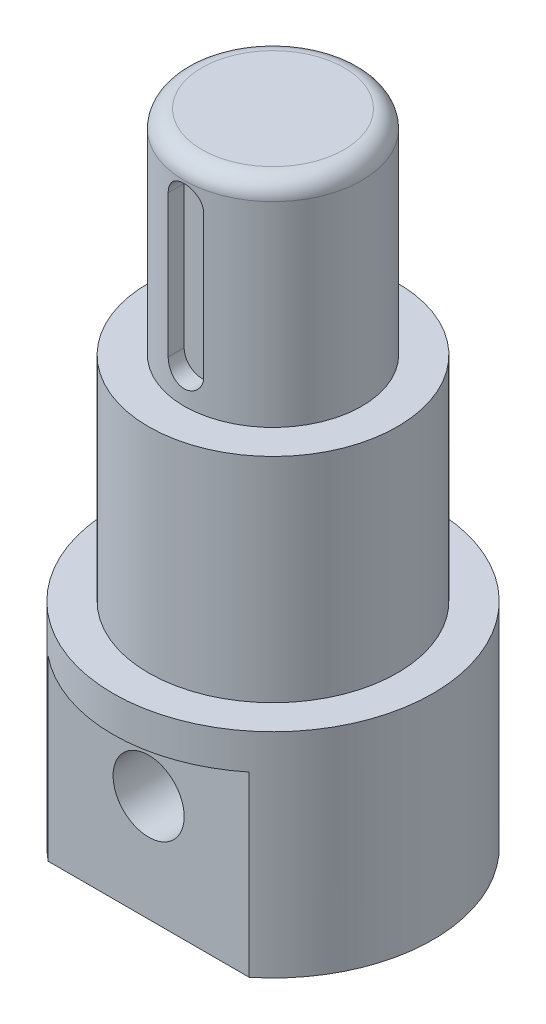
ISO-10303-21;
HEADER;
FILE_DESCRIPTION(('STEP AP214'),'2;1');
FILE_NAME('part.step','',(''),(''),'','','');
FILE_SCHEMA(('AUTOMOTIVE_DESIGN { 1 0 10303 214 1 1 1 1 }'));
ENDSEC;
DATA;
#1=APPLICATION_CONTEXT('core data for automotive mechanical design processes');
#2=APPLICATION_PROTOCOL_DEFINITION('international standard','automotive_design',2000,#1);
#3=PRODUCT_CONTEXT('',#1,'mechanical');
#4=PRODUCT('Part','Part','',(#3));
#5=PRODUCT_RELATED_PRODUCT_CATEGORY('part','',(#4));
#6=PRODUCT_DEFINITION_FORMATION('','',#4);
#7=PRODUCT_DEFINITION_CONTEXT('part definition',#1,'design');
#8=PRODUCT_DEFINITION('design','',#6,#7);
#9=PRODUCT_DEFINITION_SHAPE('','',#8);
#10=(LENGTH_UNIT() NAMED_UNIT(*) SI_UNIT(.MILLI.,.METRE.));
#11=(NAMED_UNIT(*) PLANE_ANGLE_UNIT() SI_UNIT($,.RADIAN.));
#12=(NAMED_UNIT(*) SI_UNIT($,.STERADIAN.) SOLID_ANGLE_UNIT());
#13=UNCERTAINTY_MEASURE_WITH_UNIT(LENGTH_MEASURE(1.E-05),#10,'distance_accuracy_value','');
#14=(GEOMETRIC_REPRESENTATION_CONTEXT(3) GLOBAL_UNCERTAINTY_ASSIGNED_CONTEXT((#13)) GLOBAL_UNIT_ASSIGNED_CONTEXT((#10,
#11,#12)) REPRESENTATION_CONTEXT('',''));
#15=CARTESIAN_POINT('',(0.,0.,0.));
#16=DIRECTION('',(0.,0.,1.));
#17=DIRECTION('',(1.,0.,0.));
#18=AXIS2_PLACEMENT_3D('',#15,#16,#17);
#19=CARTESIAN_POINT('',(0.,60.,0.));
#20=DIRECTION('',(0.,-1.,0.));
#21=DIRECTION('',(0.,0.,-1.));
#22=AXIS2_PLACEMENT_3D('',#19,#20,#21);
#23=CYLINDRICAL_SURFACE('',#22,10.);
#24=CARTESIAN_POINT('',(0.,58.,0.));
#25=DIRECTION('',(0.,1.,0.));
#26=DIRECTION('',(0.,0.,1.));
#27=AXIS2_PLACEMENT_3D('',#24,#25,#26);
#28=CIRCLE('',#27,10.);
#29=CARTESIAN_POINT('',(0.,58.,10.));
#30=VERTEX_POINT('',#29);
#31=EDGE_CURVE('E11',#30,#30,#28,.F.);
#32=ORIENTED_EDGE('',*,*,#31,.T.);
#33=EDGE_LOOP('',(#32));
#34=FACE_BOUND('',#33,.T.);
#35=DIRECTION('',(0.,-1.,0.));
#36=VECTOR('',#35,1.);
#37=CARTESIAN_POINT('',(-2.,60.,-9.79795897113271));
#38=LINE('',#37,#36);
#39=CARTESIAN_POINT('',(-2.,55.704671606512,-9.79795897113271));
#40=VERTEX_POINT('',#39);
#41=CARTESIAN_POINT('',(-2.,39.704671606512,-9.79795897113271));
#42=VERTEX_POINT('',#41);
#43=EDGE_CURVE('E286',#40,#42,#38,.T.);
#44=ORIENTED_EDGE('',*,*,#43,.T.);
#45=CARTESIAN_POINT('',(-2.,39.704671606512,-9.79795897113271));
#46=CARTESIAN_POINT('',(-2.00000029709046,39.6490044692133,-9.79795611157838));
#47=CARTESIAN_POINT('',(-1.99767440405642,39.5933645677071,-9.79843398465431));
#48=CARTESIAN_POINT('',(-1.98839986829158,39.4824941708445,-9.80032138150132));
#49=CARTESIAN_POINT('',(-1.98145179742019,39.4272636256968,-9.80173079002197));
#50=CARTESIAN_POINT('',(-1.95376239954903,39.2629617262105,-9.8073028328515));
#51=CARTESIAN_POINT('',(-1.92617555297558,39.1550087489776,-9.81280956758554));
#52=CARTESIAN_POINT('',(-1.85359362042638,38.9453864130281,-9.8267766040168));
#53=CARTESIAN_POINT('',(-1.80859661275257,38.8437177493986,-9.83523723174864));
#54=CARTESIAN_POINT('',(-1.7025082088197,38.6493418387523,-9.85415440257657));
#55=CARTESIAN_POINT('',(-1.64141514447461,38.5566355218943,-9.86461115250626));
#56=CARTESIAN_POINT('',(-1.50396101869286,38.381551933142,-9.88650550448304));
#57=CARTESIAN_POINT('',(-1.42741780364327,38.2993190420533,-9.89795377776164));
#58=CARTESIAN_POINT('',(-1.26162118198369,38.1487627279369,-9.92044851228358));
#59=CARTESIAN_POINT('',(-1.17236580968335,38.0804414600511,-9.93149491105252));
#60=CARTESIAN_POINT('',(-0.982720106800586,37.9590938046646,-9.95205620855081));
#61=CARTESIAN_POINT('',(-0.88223964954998,37.9062056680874,-9.96155694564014));
#62=CARTESIAN_POINT('',(-0.673602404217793,37.8181198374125,-9.97783510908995));
#63=CARTESIAN_POINT('',(-0.565446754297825,37.7829195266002,-9.9846129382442));
#64=CARTESIAN_POINT('',(-0.346034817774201,37.7316575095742,-9.99460635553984));
#65=CARTESIAN_POINT('',(-0.234838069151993,37.7153500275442,-9.99786765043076));
#66=CARTESIAN_POINT('',(-0.0112397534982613,37.7015696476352,-10.0006184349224));
#67=CARTESIAN_POINT('',(0.101161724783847,37.7040953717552,-10.000108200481));
#68=CARTESIAN_POINT('',(0.322284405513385,37.7277240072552,-9.99540868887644));
#69=CARTESIAN_POINT('',(0.431035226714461,37.7485617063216,-9.9912719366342));
#70=CARTESIAN_POINT('',(0.643464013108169,37.8078019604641,-9.97984349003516));
#71=CARTESIAN_POINT('',(0.747141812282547,37.8462050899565,-9.97255169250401));
#72=CARTESIAN_POINT('',(0.947240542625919,37.9397324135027,-9.95554578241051));
#73=CARTESIAN_POINT('',(1.04361145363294,37.9949607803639,-9.94581664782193));
#74=CARTESIAN_POINT('',(1.22581287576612,38.1204921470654,-9.92500903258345));
#75=CARTESIAN_POINT('',(1.31164251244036,38.1907963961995,-9.91393044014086));
#76=CARTESIAN_POINT('',(1.47189241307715,38.3459283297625,-9.8914207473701));
#77=CARTESIAN_POINT('',(1.54608938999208,38.4309864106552,-9.8799868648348));
#78=CARTESIAN_POINT('',(1.67922179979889,38.6124811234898,-9.85823412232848));
#79=CARTESIAN_POINT('',(1.73815300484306,38.7089208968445,-9.84791557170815));
#80=CARTESIAN_POINT('',(1.83915990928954,38.9107764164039,-9.82955460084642));
#81=CARTESIAN_POINT('',(1.881189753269,39.0162156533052,-9.8215183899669));
#82=CARTESIAN_POINT('',(1.94681419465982,39.2327888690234,-9.80872322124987));
#83=CARTESIAN_POINT('',(1.97043625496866,39.3439140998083,-9.80395938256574));
#84=CARTESIAN_POINT('',(1.98966587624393,39.4973852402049,-9.80006354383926));
#85=CARTESIAN_POINT('',(1.99354251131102,39.5387798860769,-9.79927519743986));
#86=CARTESIAN_POINT('',(1.9987063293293,39.6216673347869,-9.79822334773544));
#87=CARTESIAN_POINT('',(1.99999784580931,39.6631598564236,-9.79795896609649));
#88=CARTESIAN_POINT('',(2.,39.704671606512,-9.79795897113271));
#89=B_SPLINE_CURVE_WITH_KNOTS('',3,(#45,#46,#47,#48,#49,#50,#51,#52,#53,#54,#55,#56,#57,#58,#59,
#60,#61,#62,#63,#64,#65,#66,#67,#68,#69,#70,#71,#72,#73,#74,#75,#76,#77,#78,#79,#80,#81,#82,#83,
#84,#85,#86,#87,#88),.UNSPECIFIED.,.F.,.F.,(4,2,2,2,2,2,2,2,2,2,2,2,2,2,2,2,2,2,2,2,2,4),(0.,
0.166897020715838,0.333773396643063,0.666722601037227,0.999708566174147,1.33272905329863,
1.66993288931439,2.00718892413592,2.34737937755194,2.68751948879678,3.02318320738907,
3.35882236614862,3.68967912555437,4.0205467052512,4.35350597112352,4.68649283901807,
5.02524540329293,5.36409168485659,5.70385119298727,6.04310283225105,6.16778801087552,
6.29226399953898),.UNSPECIFIED.);
#90=CARTESIAN_POINT('',(2.,39.704671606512,-9.79795897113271));
#91=VERTEX_POINT('',#90);
#92=EDGE_CURVE('E54',#42,#91,#89,.T.);
#93=ORIENTED_EDGE('',*,*,#92,.T.);
#94=DIRECTION('',(0.,-1.,0.));
#95=VECTOR('',#94,1.);
#96=CARTESIAN_POINT('',(2.,60.,-9.79795897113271));
#97=LINE('',#96,#95);
#98=CARTESIAN_POINT('',(2.,55.704671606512,-9.79795897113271));
#99=VERTEX_POINT('',#98);
#100=EDGE_CURVE('E310',#91,#99,#97,.F.);
#101=ORIENTED_EDGE('',*,*,#100,.T.);
#102=CARTESIAN_POINT('',(2.,55.704671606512,-9.79795897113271));
#103=CARTESIAN_POINT('',(2.00000029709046,55.7603387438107,-9.79795611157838));
#104=CARTESIAN_POINT('',(1.99767440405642,55.8159786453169,-9.79843398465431));
#105=CARTESIAN_POINT('',(1.98839986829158,55.9268490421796,-9.80032138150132));
#106=CARTESIAN_POINT('',(1.98145179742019,55.9820795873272,-9.80173079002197));
#107=CARTESIAN_POINT('',(1.95376239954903,56.1463814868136,-9.8073028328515));
#108=CARTESIAN_POINT('',(1.92617555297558,56.2543344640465,-9.81280956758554));
#109=CARTESIAN_POINT('',(1.85359362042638,56.4639567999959,-9.8267766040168));
#110=CARTESIAN_POINT('',(1.80859661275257,56.5656254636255,-9.83523723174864));
#111=CARTESIAN_POINT('',(1.7025082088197,56.7600013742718,-9.85415440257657));
#112=CARTESIAN_POINT('',(1.64141514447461,56.8527076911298,-9.86461115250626));
#113=CARTESIAN_POINT('',(1.50396101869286,57.0277912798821,-9.88650550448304));
#114=CARTESIAN_POINT('',(1.42741780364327,57.1100241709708,-9.89795377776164));
#115=CARTESIAN_POINT('',(1.26162118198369,57.2605804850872,-9.92044851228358));
#116=CARTESIAN_POINT('',(1.17236580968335,57.328901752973,-9.93149491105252));
#117=CARTESIAN_POINT('',(0.982720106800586,57.4502494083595,-9.95205620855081));
#118=CARTESIAN_POINT('',(0.882239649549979,57.5031375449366,-9.96155694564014));
#119=CARTESIAN_POINT('',(0.673602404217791,57.5912233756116,-9.97783510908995));
#120=CARTESIAN_POINT('',(0.565446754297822,57.6264236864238,-9.9846129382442));
#121=CARTESIAN_POINT('',(0.346034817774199,57.6776857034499,-9.99460635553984));
#122=CARTESIAN_POINT('',(0.23483806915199,57.6939931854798,-9.99786765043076));
#123=CARTESIAN_POINT('',(0.0112397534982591,57.7077735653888,-10.0006184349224));
#124=CARTESIAN_POINT('',(-0.101161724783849,57.7052478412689,-10.000108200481));
#125=CARTESIAN_POINT('',(-0.322284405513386,57.6816192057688,-9.99540868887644));
#126=CARTESIAN_POINT('',(-0.431035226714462,57.6607815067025,-9.9912719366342));
#127=CARTESIAN_POINT('',(-0.64346401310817,57.6015412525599,-9.97984349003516));
#128=CARTESIAN_POINT('',(-0.747141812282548,57.5631381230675,-9.97255169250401));
#129=CARTESIAN_POINT('',(-0.94724054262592,57.4696107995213,-9.95554578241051));
#130=CARTESIAN_POINT('',(-1.04361145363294,57.4143824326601,-9.94581664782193));
#131=CARTESIAN_POINT('',(-1.22581287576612,57.2888510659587,-9.92500903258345));
#132=CARTESIAN_POINT('',(-1.31164251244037,57.2185468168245,-9.91393044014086));
#133=CARTESIAN_POINT('',(-1.47189241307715,57.0634148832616,-9.89142074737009));
#134=CARTESIAN_POINT('',(-1.54608938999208,56.9783568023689,-9.87998686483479));
#135=CARTESIAN_POINT('',(-1.6792217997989,56.7968620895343,-9.85823412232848));
#136=CARTESIAN_POINT('',(-1.73815300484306,56.7004223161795,-9.84791557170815));
#137=CARTESIAN_POINT('',(-1.83915990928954,56.4985667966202,-9.82955460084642));
#138=CARTESIAN_POINT('',(-1.881189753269,56.3931275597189,-9.8215183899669));
#139=CARTESIAN_POINT('',(-1.94681419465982,56.1765543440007,-9.80872322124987));
#140=CARTESIAN_POINT('',(-1.97043625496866,56.0654291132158,-9.80395938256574));
#141=CARTESIAN_POINT('',(-1.98966587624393,55.9119579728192,-9.80006354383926));
#142=CARTESIAN_POINT('',(-1.99354251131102,55.8705633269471,-9.79927519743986));
#143=CARTESIAN_POINT('',(-1.9987063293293,55.7876758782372,-9.79822334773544));
#144=CARTESIAN_POINT('',(-1.99999784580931,55.7461833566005,-9.79795896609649));
#145=CARTESIAN_POINT('',(-2.,55.704671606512,-9.79795897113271));
#146=B_SPLINE_CURVE_WITH_KNOTS('',3,(#102,#103,#104,#105,#106,#107,#108,#109,#110,#111,#112,
#113,#114,#115,#116,#117,#118,#119,#120,#121,#122,#123,#124,#125,#126,#127,#128,#129,#130,#131,
#132,#133,#134,#135,#136,#137,#138,#139,#140,#141,#142,#143,#144,#145),.UNSPECIFIED.,.F.,.F.,(4,
2,2,2,2,2,2,2,2,2,2,2,2,2,2,2,2,2,2,2,2,4),(0.,0.166897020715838,0.333773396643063,
0.666722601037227,0.999708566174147,1.33272905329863,1.66993288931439,2.00718892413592,
2.34737937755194,2.68751948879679,3.02318320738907,3.35882236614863,3.68967912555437,
4.0205467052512,4.35350597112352,4.68649283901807,5.02524540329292,5.36409168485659,
5.70385119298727,6.04310283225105,6.16778801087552,6.29226399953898),.UNSPECIFIED.);
#147=EDGE_CURVE('E137',#99,#40,#146,.T.);
#148=ORIENTED_EDGE('',*,*,#147,.T.);
#149=EDGE_LOOP('',(#44,#93,#101,#148));
#150=FACE_BOUND('',#149,.T.);
#151=CARTESIAN_POINT('',(0.,36.,0.));
#152=DIRECTION('',(0.,1.,0.));
#153=DIRECTION('',(0.,0.,1.));
#154=AXIS2_PLACEMENT_3D('',#151,#152,#153);
#155=CIRCLE('',#154,10.);
#156=CARTESIAN_POINT('',(0.,36.,10.));
#157=VERTEX_POINT('',#156);
#158=EDGE_CURVE('E183',#157,#157,#155,.T.);
#159=ORIENTED_EDGE('',*,*,#158,.T.);
#160=EDGE_LOOP('',(#159));
#161=FACE_BOUND('',#160,.T.);
#162=CARTESIAN_POINT('',(-2.,39.704671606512,9.79795897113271));
#163=CARTESIAN_POINT('',(-2.00000029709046,39.6490044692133,9.79795611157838));
#164=CARTESIAN_POINT('',(-1.99767440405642,39.5933645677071,9.79843398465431));
#165=CARTESIAN_POINT('',(-1.98839986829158,39.4824941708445,9.80032138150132));
#166=CARTESIAN_POINT('',(-1.98145179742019,39.4272636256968,9.80173079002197));
#167=CARTESIAN_POINT('',(-1.95376239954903,39.2629617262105,9.8073028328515));
#168=CARTESIAN_POINT('',(-1.92617555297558,39.1550087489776,9.81280956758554));
#169=CARTESIAN_POINT('',(-1.85359362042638,38.9453864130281,9.8267766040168));
#170=CARTESIAN_POINT('',(-1.80859661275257,38.8437177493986,9.83523723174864));
#171=CARTESIAN_POINT('',(-1.7025082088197,38.6493418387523,9.85415440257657));
#172=CARTESIAN_POINT('',(-1.64141514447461,38.5566355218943,9.86461115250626));
#173=CARTESIAN_POINT('',(-1.50396101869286,38.381551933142,9.88650550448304));
#174=CARTESIAN_POINT('',(-1.42741780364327,38.2993190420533,9.89795377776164));
#175=CARTESIAN_POINT('',(-1.26162118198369,38.1487627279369,9.92044851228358));
#176=CARTESIAN_POINT('',(-1.17236580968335,38.0804414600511,9.93149491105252));
#177=CARTESIAN_POINT('',(-0.982720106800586,37.9590938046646,9.95205620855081));
#178=CARTESIAN_POINT('',(-0.88223964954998,37.9062056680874,9.96155694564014));
#179=CARTESIAN_POINT('',(-0.673602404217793,37.8181198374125,9.97783510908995));
#180=CARTESIAN_POINT('',(-0.565446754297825,37.7829195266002,9.9846129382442));
#181=CARTESIAN_POINT('',(-0.346034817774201,37.7316575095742,9.99460635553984));
#182=CARTESIAN_POINT('',(-0.234838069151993,37.7153500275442,9.99786765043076));
#183=CARTESIAN_POINT('',(-0.0112397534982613,37.7015696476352,10.0006184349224));
#184=CARTESIAN_POINT('',(0.101161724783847,37.7040953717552,10.000108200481));
#185=CARTESIAN_POINT('',(0.322284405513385,37.7277240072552,9.99540868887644));
#186=CARTESIAN_POINT('',(0.431035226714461,37.7485617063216,9.9912719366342));
#187=CARTESIAN_POINT('',(0.643464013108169,37.8078019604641,9.97984349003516));
#188=CARTESIAN_POINT('',(0.747141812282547,37.8462050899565,9.97255169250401));
#189=CARTESIAN_POINT('',(0.947240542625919,37.9397324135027,9.95554578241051));
#190=CARTESIAN_POINT('',(1.04361145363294,37.9949607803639,9.94581664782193));
#191=CARTESIAN_POINT('',(1.22581287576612,38.1204921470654,9.92500903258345));
#192=CARTESIAN_POINT('',(1.31164251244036,38.1907963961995,9.91393044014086));
#193=CARTESIAN_POINT('',(1.47189241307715,38.3459283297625,9.8914207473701));
#194=CARTESIAN_POINT('',(1.54608938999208,38.4309864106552,9.8799868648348));
#195=CARTESIAN_POINT('',(1.67922179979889,38.6124811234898,9.85823412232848));
#196=CARTESIAN_POINT('',(1.73815300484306,38.7089208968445,9.84791557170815));
#197=CARTESIAN_POINT('',(1.83915990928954,38.9107764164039,9.82955460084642));
#198=CARTESIAN_POINT('',(1.881189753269,39.0162156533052,9.8215183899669));
#199=CARTESIAN_POINT('',(1.94681419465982,39.2327888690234,9.80872322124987));
#200=CARTESIAN_POINT('',(1.97043625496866,39.3439140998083,9.80395938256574));
#201=CARTESIAN_POINT('',(1.98966587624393,39.4973852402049,9.80006354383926));
#202=CARTESIAN_POINT('',(1.99354251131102,39.5387798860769,9.79927519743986));
#203=CARTESIAN_POINT('',(1.9987063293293,39.6216673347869,9.79822334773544));
#204=CARTESIAN_POINT('',(1.99999784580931,39.6631598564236,9.79795896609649));
#205=CARTESIAN_POINT('',(2.,39.704671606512,9.79795897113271));
#206=B_SPLINE_CURVE_WITH_KNOTS('',3,(#162,#163,#164,#165,#166,#167,#168,#169,#170,#171,#172,
#173,#174,#175,#176,#177,#178,#179,#180,#181,#182,#183,#184,#185,#186,#187,#188,#189,#190,#191,
#192,#193,#194,#195,#196,#197,#198,#199,#200,#201,#202,#203,#204,#205),.UNSPECIFIED.,.F.,.F.,(4,
2,2,2,2,2,2,2,2,2,2,2,2,2,2,2,2,2,2,2,2,4),(0.,0.166897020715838,0.333773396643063,
0.666722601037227,0.999708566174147,1.33272905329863,1.66993288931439,2.00718892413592,
2.34737937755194,2.68751948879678,3.02318320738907,3.35882236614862,3.68967912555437,
4.0205467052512,4.35350597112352,4.68649283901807,5.02524540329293,5.36409168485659,
5.70385119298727,6.04310283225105,6.16778801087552,6.29226399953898),.UNSPECIFIED.);
#207=CARTESIAN_POINT('',(-2.,39.704671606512,9.79795897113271));
#208=VERTEX_POINT('',#207);
#209=CARTESIAN_POINT('',(2.,39.704671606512,9.79795897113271));
#210=VERTEX_POINT('',#209);
#211=EDGE_CURVE('E186',#208,#210,#206,.T.);
#212=ORIENTED_EDGE('',*,*,#211,.F.);
#213=DIRECTION('',(0.,-1.,0.));
#214=VECTOR('',#213,1.);
#215=CARTESIAN_POINT('',(-2.,60.,9.79795897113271));
#216=LINE('',#215,#214);
#217=CARTESIAN_POINT('',(-2.,55.704671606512,9.79795897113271));
#218=VERTEX_POINT('',#217);
#219=EDGE_CURVE('E292',#218,#208,#216,.T.);
#220=ORIENTED_EDGE('',*,*,#219,.F.);
#221=CARTESIAN_POINT('',(2.,55.704671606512,9.79795897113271));
#222=CARTESIAN_POINT('',(2.00000029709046,55.7603387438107,9.79795611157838));
#223=CARTESIAN_POINT('',(1.99767440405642,55.8159786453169,9.79843398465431));
#224=CARTESIAN_POINT('',(1.98839986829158,55.9268490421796,9.80032138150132));
#225=CARTESIAN_POINT('',(1.98145179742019,55.9820795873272,9.80173079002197));
#226=CARTESIAN_POINT('',(1.95376239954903,56.1463814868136,9.8073028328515));
#227=CARTESIAN_POINT('',(1.92617555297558,56.2543344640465,9.81280956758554));
#228=CARTESIAN_POINT('',(1.85359362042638,56.4639567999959,9.8267766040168));
#229=CARTESIAN_POINT('',(1.80859661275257,56.5656254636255,9.83523723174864));
#230=CARTESIAN_POINT('',(1.7025082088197,56.7600013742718,9.85415440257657));
#231=CARTESIAN_POINT('',(1.64141514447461,56.8527076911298,9.86461115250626));
#232=CARTESIAN_POINT('',(1.50396101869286,57.0277912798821,9.88650550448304));
#233=CARTESIAN_POINT('',(1.42741780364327,57.1100241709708,9.89795377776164));
#234=CARTESIAN_POINT('',(1.26162118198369,57.2605804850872,9.92044851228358));
#235=CARTESIAN_POINT('',(1.17236580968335,57.328901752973,9.93149491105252));
#236=CARTESIAN_POINT('',(0.982720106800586,57.4502494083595,9.95205620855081));
#237=CARTESIAN_POINT('',(0.882239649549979,57.5031375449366,9.96155694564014));
#238=CARTESIAN_POINT('',(0.673602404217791,57.5912233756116,9.97783510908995));
#239=CARTESIAN_POINT('',(0.565446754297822,57.6264236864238,9.9846129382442));
#240=CARTESIAN_POINT('',(0.346034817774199,57.6776857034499,9.99460635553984));
#241=CARTESIAN_POINT('',(0.23483806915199,57.6939931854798,9.99786765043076));
#242=CARTESIAN_POINT('',(0.0112397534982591,57.7077735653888,10.0006184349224));
#243=CARTESIAN_POINT('',(-0.101161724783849,57.7052478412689,10.000108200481));
#244=CARTESIAN_POINT('',(-0.322284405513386,57.6816192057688,9.99540868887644));
#245=CARTESIAN_POINT('',(-0.431035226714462,57.6607815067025,9.9912719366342));
#246=CARTESIAN_POINT('',(-0.64346401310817,57.6015412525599,9.97984349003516));
#247=CARTESIAN_POINT('',(-0.747141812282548,57.5631381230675,9.97255169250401));
#248=CARTESIAN_POINT('',(-0.94724054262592,57.4696107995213,9.95554578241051));
#249=CARTESIAN_POINT('',(-1.04361145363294,57.4143824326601,9.94581664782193));
#250=CARTESIAN_POINT('',(-1.22581287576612,57.2888510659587,9.92500903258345));
#251=CARTESIAN_POINT('',(-1.31164251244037,57.2185468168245,9.91393044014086));
#252=CARTESIAN_POINT('',(-1.47189241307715,57.0634148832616,9.89142074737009));
#253=CARTESIAN_POINT('',(-1.54608938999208,56.9783568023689,9.87998686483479));
#254=CARTESIAN_POINT('',(-1.6792217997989,56.7968620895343,9.85823412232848));
#255=CARTESIAN_POINT('',(-1.73815300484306,56.7004223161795,9.84791557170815));
#256=CARTESIAN_POINT('',(-1.83915990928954,56.4985667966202,9.82955460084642));
#257=CARTESIAN_POINT('',(-1.881189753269,56.3931275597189,9.8215183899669));
#258=CARTESIAN_POINT('',(-1.94681419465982,56.1765543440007,9.80872322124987));
#259=CARTESIAN_POINT('',(-1.97043625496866,56.0654291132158,9.80395938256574));
#260=CARTESIAN_POINT('',(-1.98966587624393,55.9119579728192,9.80006354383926));
#261=CARTESIAN_POINT('',(-1.99354251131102,55.8705633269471,9.79927519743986));
#262=CARTESIAN_POINT('',(-1.9987063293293,55.7876758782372,9.79822334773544));
#263=CARTESIAN_POINT('',(-1.99999784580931,55.7461833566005,9.79795896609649));
#264=CARTESIAN_POINT('',(-2.,55.704671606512,9.79795897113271));
#265=B_SPLINE_CURVE_WITH_KNOTS('',3,(#221,#222,#223,#224,#225,#226,#227,#228,#229,#230,#231,
#232,#233,#234,#235,#236,#237,#238,#239,#240,#241,#242,#243,#244,#245,#246,#247,#248,#249,#250,
#251,#252,#253,#254,#255,#256,#257,#258,#259,#260,#261,#262,#263,#264),.UNSPECIFIED.,.F.,.F.,(4,
2,2,2,2,2,2,2,2,2,2,2,2,2,2,2,2,2,2,2,2,4),(0.,0.166897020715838,0.333773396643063,
0.666722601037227,0.999708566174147,1.33272905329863,1.66993288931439,2.00718892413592,
2.34737937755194,2.68751948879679,3.02318320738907,3.35882236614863,3.68967912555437,
4.0205467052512,4.35350597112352,4.68649283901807,5.02524540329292,5.36409168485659,
5.70385119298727,6.04310283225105,6.16778801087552,6.29226399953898),.UNSPECIFIED.);
#266=CARTESIAN_POINT('',(2.,55.704671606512,9.79795897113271));
#267=VERTEX_POINT('',#266);
#268=EDGE_CURVE('E237',#267,#218,#265,.T.);
#269=ORIENTED_EDGE('',*,*,#268,.F.);
#270=DIRECTION('',(0.,-1.,0.));
#271=VECTOR('',#270,1.);
#272=CARTESIAN_POINT('',(2.,60.,9.79795897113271));
#273=LINE('',#272,#271);
#274=EDGE_CURVE('E293',#210,#267,#273,.F.);
#275=ORIENTED_EDGE('',*,*,#274,.F.);
#276=EDGE_LOOP('',(#212,#220,#269,#275));
#277=FACE_BOUND('',#276,.T.);
#278=ADVANCED_FACE('F39',(#34,#150,#161,#277),#23,.T.);
#279=CARTESIAN_POINT('',(0.,12.,0.));
#280=DIRECTION('',(0.,-1.,0.));
#281=DIRECTION('',(0.,0.,-1.));
#282=AXIS2_PLACEMENT_3D('',#279,#280,#281);
#283=CYLINDRICAL_SURFACE('',#282,18.);
#284=CARTESIAN_POINT('',(0.,12.,0.));
#285=DIRECTION('',(0.,1.,0.));
#286=DIRECTION('',(0.,0.,1.));
#287=AXIS2_PLACEMENT_3D('',#284,#285,#286);
#288=CIRCLE('',#287,18.);
#289=CARTESIAN_POINT('',(0.,12.,18.));
#290=VERTEX_POINT('',#289);
#291=EDGE_CURVE('E217',#290,#290,#288,.T.);
#292=ORIENTED_EDGE('',*,*,#291,.F.);
#293=EDGE_LOOP('',(#292));
#294=FACE_BOUND('',#293,.T.);
#295=DIRECTION('',(0.,-1.,0.));
#296=VECTOR('',#295,1.);
#297=CARTESIAN_POINT('',(11.3137084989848,12.,-14.));
#298=LINE('',#297,#296);
#299=CARTESIAN_POINT('',(11.3137084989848,8.,-14.));
#300=VERTEX_POINT('',#299);
#301=CARTESIAN_POINT('',(11.3137084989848,-12.,-14.));
#302=VERTEX_POINT('',#301);
#303=EDGE_CURVE('E202',#300,#302,#298,.T.);
#304=ORIENTED_EDGE('',*,*,#303,.F.);
#305=CARTESIAN_POINT('',(0.,8.,0.));
#306=DIRECTION('',(0.,-1.,0.));
#307=DIRECTION('',(0.,0.,-1.));
#308=AXIS2_PLACEMENT_3D('',#305,#306,#307);
#309=CIRCLE('',#308,18.);
#310=CARTESIAN_POINT('',(-11.3137084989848,8.,-14.));
#311=VERTEX_POINT('',#310);
#312=EDGE_CURVE('E193',#311,#300,#309,.T.);
#313=ORIENTED_EDGE('',*,*,#312,.F.);
#314=DIRECTION('',(0.,-1.,0.));
#315=VECTOR('',#314,1.);
#316=CARTESIAN_POINT('',(-11.3137084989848,12.,-14.));
#317=LINE('',#316,#315);
#318=CARTESIAN_POINT('',(-11.3137084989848,-12.,-14.));
#319=VERTEX_POINT('',#318);
#320=EDGE_CURVE('E200',#319,#311,#317,.F.);
#321=ORIENTED_EDGE('',*,*,#320,.F.);
#322=CARTESIAN_POINT('',(0.,-12.,0.));
#323=DIRECTION('',(0.,1.,0.));
#324=DIRECTION('',(0.,0.,1.));
#325=AXIS2_PLACEMENT_3D('',#322,#323,#324);
#326=CIRCLE('',#325,18.);
#327=CARTESIAN_POINT('',(-11.3137084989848,-12.,14.));
#328=VERTEX_POINT('',#327);
#329=EDGE_CURVE('E216',#319,#328,#326,.T.);
#330=ORIENTED_EDGE('',*,*,#329,.T.);
#331=DIRECTION('',(0.,-1.,0.));
#332=VECTOR('',#331,1.);
#333=CARTESIAN_POINT('',(-11.3137084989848,12.,14.));
#334=LINE('',#333,#332);
#335=CARTESIAN_POINT('',(-11.3137084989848,8.,14.));
#336=VERTEX_POINT('',#335);
#337=EDGE_CURVE('E210',#328,#336,#334,.F.);
#338=ORIENTED_EDGE('',*,*,#337,.T.);
#339=CARTESIAN_POINT('',(0.,8.,0.));
#340=DIRECTION('',(0.,1.,0.));
#341=DIRECTION('',(0.,0.,1.));
#342=AXIS2_PLACEMENT_3D('',#339,#340,#341);
#343=CIRCLE('',#342,18.);
#344=CARTESIAN_POINT('',(11.3137084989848,8.,14.));
#345=VERTEX_POINT('',#344);
#346=EDGE_CURVE('E220',#336,#345,#343,.T.);
#347=ORIENTED_EDGE('',*,*,#346,.T.);
#348=DIRECTION('',(0.,-1.,0.));
#349=VECTOR('',#348,1.);
#350=CARTESIAN_POINT('',(11.3137084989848,12.,14.));
#351=LINE('',#350,#349);
#352=CARTESIAN_POINT('',(11.3137084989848,-12.,14.));
#353=VERTEX_POINT('',#352);
#354=EDGE_CURVE('E213',#345,#353,#351,.T.);
#355=ORIENTED_EDGE('',*,*,#354,.T.);
#356=EDGE_CURVE('E221',#353,#302,#326,.T.);
#357=ORIENTED_EDGE('',*,*,#356,.T.);
#358=EDGE_LOOP('',(#304,#313,#321,#330,#338,#347,#355,#357));
#359=FACE_BOUND('',#358,.T.);
#360=ADVANCED_FACE('F274',(#294,#359),#283,.T.);
#361=CARTESIAN_POINT('',(0.,-12.,0.));
#362=DIRECTION('',(0.,1.,0.));
#363=DIRECTION('',(0.,0.,1.));
#364=AXIS2_PLACEMENT_3D('',#361,#362,#363);
#365=PLANE('',#364);
#366=DIRECTION('',(1.,0.,0.));
#367=VECTOR('',#366,1.);
#368=CARTESIAN_POINT('',(-18.,-12.,-14.));
#369=LINE('',#368,#367);
#370=EDGE_CURVE('E194',#319,#302,#369,.T.);
#371=ORIENTED_EDGE('',*,*,#370,.T.);
#372=ORIENTED_EDGE('',*,*,#356,.F.);
#373=DIRECTION('',(1.,0.,0.));
#374=VECTOR('',#373,1.);
#375=CARTESIAN_POINT('',(-18.,-12.,14.));
#376=LINE('',#375,#374);
#377=EDGE_CURVE('E204',#328,#353,#376,.T.);
#378=ORIENTED_EDGE('',*,*,#377,.F.);
#379=ORIENTED_EDGE('',*,*,#329,.F.);
#380=EDGE_LOOP('',(#371,#372,#378,#379));
#381=FACE_BOUND('',#380,.T.);
#382=ADVANCED_FACE('F280',(#381),#365,.F.);
#383=CARTESIAN_POINT('',(0.,0.,-18.));
#384=DIRECTION('',(0.,0.,1.));
#385=DIRECTION('',(1.,0.,0.));
#386=AXIS2_PLACEMENT_3D('',#383,#384,#385);
#387=CYLINDRICAL_SURFACE('',#386,4.);
#388=CARTESIAN_POINT('',(0.,0.,14.));
#389=DIRECTION('',(0.,0.,-1.));
#390=DIRECTION('',(0.,1.,0.));
#391=AXIS2_PLACEMENT_3D('',#388,#389,#390);
#392=CIRCLE('',#391,4.);
#393=CARTESIAN_POINT('',(0.,4.,14.));
#394=VERTEX_POINT('',#393);
#395=EDGE_CURVE('E208',#394,#394,#392,.F.);
#396=ORIENTED_EDGE('',*,*,#395,.T.);
#397=EDGE_LOOP('',(#396));
#398=FACE_BOUND('',#397,.T.);
#399=CARTESIAN_POINT('',(0.,0.,-14.));
#400=DIRECTION('',(0.,0.,-1.));
#401=DIRECTION('',(0.,1.,0.));
#402=AXIS2_PLACEMENT_3D('',#399,#400,#401);
#403=CIRCLE('',#402,4.);
#404=CARTESIAN_POINT('',(0.,4.,-14.));
#405=VERTEX_POINT('',#404);
#406=EDGE_CURVE('E197',#405,#405,#403,.F.);
#407=ORIENTED_EDGE('',*,*,#406,.F.);
#408=EDGE_LOOP('',(#407));
#409=FACE_BOUND('',#408,.T.);
#410=ADVANCED_FACE('F405',(#398,#409),#387,.F.);
#411=CARTESIAN_POINT('',(0.,12.,0.));
#412=DIRECTION('',(0.,1.,0.));
#413=DIRECTION('',(0.,0.,1.));
#414=AXIS2_PLACEMENT_3D('',#411,#412,#413);
#415=PLANE('',#414);
#416=CARTESIAN_POINT('',(0.,12.,0.));
#417=DIRECTION('',(0.,1.,0.));
#418=DIRECTION('',(0.,0.,1.));
#419=AXIS2_PLACEMENT_3D('',#416,#417,#418);
#420=CIRCLE('',#419,14.);
#421=CARTESIAN_POINT('',(0.,12.,14.));
#422=VERTEX_POINT('',#421);
#423=EDGE_CURVE('E187',#422,#422,#420,.T.);
#424=ORIENTED_EDGE('',*,*,#423,.F.);
#425=EDGE_LOOP('',(#424));
#426=FACE_BOUND('',#425,.T.);
#427=ORIENTED_EDGE('',*,*,#291,.T.);
#428=EDGE_LOOP('',(#427));
#429=FACE_BOUND('',#428,.T.);
#430=ADVANCED_FACE('F400',(#426,#429),#415,.T.);
#431=CARTESIAN_POINT('',(-18.,8.,18.));
#432=DIRECTION('',(0.,1.,0.));
#433=DIRECTION('',(0.,0.,1.));
#434=AXIS2_PLACEMENT_3D('',#431,#432,#433);
#435=PLANE('',#434);
#436=ORIENTED_EDGE('',*,*,#346,.F.);
#437=DIRECTION('',(1.,0.,0.));
#438=VECTOR('',#437,1.);
#439=CARTESIAN_POINT('',(-18.,8.,14.));
#440=LINE('',#439,#438);
#441=EDGE_CURVE('E205',#336,#345,#440,.T.);
#442=ORIENTED_EDGE('',*,*,#441,.T.);
#443=EDGE_LOOP('',(#436,#442));
#444=FACE_BOUND('',#443,.T.);
#445=ADVANCED_FACE('F404',(#444),#435,.F.);
#446=CARTESIAN_POINT('',(-18.,8.,14.));
#447=DIRECTION('',(0.,0.,-1.));
#448=DIRECTION('',(0.,1.,0.));
#449=AXIS2_PLACEMENT_3D('',#446,#447,#448);
#450=PLANE('',#449);
#451=ORIENTED_EDGE('',*,*,#395,.F.);
#452=EDGE_LOOP('',(#451));
#453=FACE_BOUND('',#452,.T.);
#454=ORIENTED_EDGE('',*,*,#441,.F.);
#455=ORIENTED_EDGE('',*,*,#337,.F.);
#456=ORIENTED_EDGE('',*,*,#377,.T.);
#457=ORIENTED_EDGE('',*,*,#354,.F.);
#458=EDGE_LOOP('',(#454,#455,#456,#457));
#459=FACE_BOUND('',#458,.T.);
#460=ADVANCED_FACE('F423',(#453,#459),#450,.F.);
#461=CARTESIAN_POINT('',(-18.,8.,-18.));
#462=DIRECTION('',(0.,-1.,0.));
#463=DIRECTION('',(0.,0.,-1.));
#464=AXIS2_PLACEMENT_3D('',#461,#462,#463);
#465=PLANE('',#464);
#466=ORIENTED_EDGE('',*,*,#312,.T.);
#467=DIRECTION('',(1.,0.,0.));
#468=VECTOR('',#467,1.);
#469=CARTESIAN_POINT('',(-18.,8.,-14.));
#470=LINE('',#469,#468);
#471=EDGE_CURVE('E190',#311,#300,#470,.T.);
#472=ORIENTED_EDGE('',*,*,#471,.F.);
#473=EDGE_LOOP('',(#466,#472));
#474=FACE_BOUND('',#473,.T.);
#475=ADVANCED_FACE('F414',(#474),#465,.T.);
#476=CARTESIAN_POINT('',(-18.,8.,-14.));
#477=DIRECTION('',(0.,0.,-1.));
#478=DIRECTION('',(0.,1.,0.));
#479=AXIS2_PLACEMENT_3D('',#476,#477,#478);
#480=PLANE('',#479);
#481=ORIENTED_EDGE('',*,*,#406,.T.);
#482=EDGE_LOOP('',(#481));
#483=FACE_BOUND('',#482,.T.);
#484=ORIENTED_EDGE('',*,*,#303,.T.);
#485=ORIENTED_EDGE('',*,*,#370,.F.);
#486=ORIENTED_EDGE('',*,*,#320,.T.);
#487=ORIENTED_EDGE('',*,*,#471,.T.);
#488=EDGE_LOOP('',(#484,#485,#486,#487));
#489=FACE_BOUND('',#488,.T.);
#490=ADVANCED_FACE('F393',(#483,#489),#480,.T.);
#491=CARTESIAN_POINT('',(0.,36.,0.));
#492=DIRECTION('',(0.,-1.,0.));
#493=DIRECTION('',(0.,0.,-1.));
#494=AXIS2_PLACEMENT_3D('',#491,#492,#493);
#495=CYLINDRICAL_SURFACE('',#494,14.);
#496=CARTESIAN_POINT('',(0.,36.,0.));
#497=DIRECTION('',(0.,1.,0.));
#498=DIRECTION('',(0.,0.,1.));
#499=AXIS2_PLACEMENT_3D('',#496,#497,#498);
#500=CIRCLE('',#499,14.);
#501=CARTESIAN_POINT('',(0.,36.,14.));
#502=VERTEX_POINT('',#501);
#503=EDGE_CURVE('E182',#502,#502,#500,.T.);
#504=ORIENTED_EDGE('',*,*,#503,.F.);
#505=EDGE_LOOP('',(#504));
#506=FACE_BOUND('',#505,.T.);
#507=ORIENTED_EDGE('',*,*,#423,.T.);
#508=EDGE_LOOP('',(#507));
#509=FACE_BOUND('',#508,.T.);
#510=ADVANCED_FACE('F271',(#506,#509),#495,.T.);
#511=CARTESIAN_POINT('',(0.,36.,0.));
#512=DIRECTION('',(0.,1.,0.));
#513=DIRECTION('',(0.,0.,1.));
#514=AXIS2_PLACEMENT_3D('',#511,#512,#513);
#515=PLANE('',#514);
#516=ORIENTED_EDGE('',*,*,#158,.F.);
#517=EDGE_LOOP('',(#516));
#518=FACE_BOUND('',#517,.T.);
#519=ORIENTED_EDGE('',*,*,#503,.T.);
#520=EDGE_LOOP('',(#519));
#521=FACE_BOUND('',#520,.T.);
#522=ADVANCED_FACE('F264',(#518,#521),#515,.T.);
#523=CARTESIAN_POINT('',(0.,60.,0.));
#524=DIRECTION('',(0.,1.,0.));
#525=DIRECTION('',(0.,0.,1.));
#526=AXIS2_PLACEMENT_3D('',#523,#524,#525);
#527=PLANE('',#526);
#528=CARTESIAN_POINT('',(0.,60.,0.));
#529=DIRECTION('',(0.,1.,0.));
#530=DIRECTION('',(0.,0.,1.));
#531=AXIS2_PLACEMENT_3D('',#528,#529,#530);
#532=CIRCLE('',#531,8.);
#533=CARTESIAN_POINT('',(0.,60.,8.));
#534=VERTEX_POINT('',#533);
#535=EDGE_CURVE('E47',#534,#534,#532,.T.);
#536=ORIENTED_EDGE('',*,*,#535,.T.);
#537=EDGE_LOOP('',(#536));
#538=FACE_BOUND('',#537,.T.);
#539=ADVANCED_FACE('F261',(#538),#527,.T.);
#540=CARTESIAN_POINT('',(0.,55.704671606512,10.));
#541=DIRECTION('',(0.,0.,-1.));
#542=DIRECTION('',(-1.,0.,0.));
#543=AXIS2_PLACEMENT_3D('',#540,#541,#542);
#544=CYLINDRICAL_SURFACE('',#543,2.);
#545=DIRECTION('',(0.,0.,-1.));
#546=VECTOR('',#545,1.);
#547=CARTESIAN_POINT('',(2.,55.704671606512,10.));
#548=LINE('',#547,#546);
#549=CARTESIAN_POINT('',(2.,55.704671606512,8.));
#550=VERTEX_POINT('',#549);
#551=EDGE_CURVE('E175',#267,#550,#548,.T.);
#552=ORIENTED_EDGE('',*,*,#551,.F.);
#553=ORIENTED_EDGE('',*,*,#268,.T.);
#554=DIRECTION('',(0.,0.,-1.));
#555=VECTOR('',#554,1.);
#556=CARTESIAN_POINT('',(-2.,55.704671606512,10.));
#557=LINE('',#556,#555);
#558=CARTESIAN_POINT('',(-2.,55.704671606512,8.));
#559=VERTEX_POINT('',#558);
#560=EDGE_CURVE('E180',#218,#559,#557,.T.);
#561=ORIENTED_EDGE('',*,*,#560,.T.);
#562=CARTESIAN_POINT('',(0.,55.704671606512,8.));
#563=DIRECTION('',(0.,0.,1.));
#564=DIRECTION('',(1.,0.,0.));
#565=AXIS2_PLACEMENT_3D('',#562,#563,#564);
#566=CIRCLE('',#565,2.);
#567=EDGE_CURVE('E141',#550,#559,#566,.T.);
#568=ORIENTED_EDGE('',*,*,#567,.F.);
#569=EDGE_LOOP('',(#552,#553,#561,#568));
#570=FACE_BOUND('',#569,.T.);
#571=ADVANCED_FACE('F257',(#570),#544,.F.);
#572=CARTESIAN_POINT('',(-2.,55.704671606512,10.));
#573=DIRECTION('',(1.,0.,0.));
#574=DIRECTION('',(0.,0.,-1.));
#575=AXIS2_PLACEMENT_3D('',#572,#573,#574);
#576=PLANE('',#575);
#577=ORIENTED_EDGE('',*,*,#219,.T.);
#578=DIRECTION('',(0.,0.,-1.));
#579=VECTOR('',#578,1.);
#580=CARTESIAN_POINT('',(-2.,39.704671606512,10.));
#581=LINE('',#580,#579);
#582=CARTESIAN_POINT('',(-2.,39.704671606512,8.));
#583=VERTEX_POINT('',#582);
#584=EDGE_CURVE('E178',#208,#583,#581,.T.);
#585=ORIENTED_EDGE('',*,*,#584,.T.);
#586=DIRECTION('',(0.,-1.,0.));
#587=VECTOR('',#586,1.);
#588=CARTESIAN_POINT('',(-2.,55.704671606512,8.));
#589=LINE('',#588,#587);
#590=EDGE_CURVE('E166',#559,#583,#589,.T.);
#591=ORIENTED_EDGE('',*,*,#590,.F.);
#592=ORIENTED_EDGE('',*,*,#560,.F.);
#593=EDGE_LOOP('',(#577,#585,#591,#592));
#594=FACE_BOUND('',#593,.T.);
#595=ADVANCED_FACE('F253',(#594),#576,.T.);
#596=CARTESIAN_POINT('',(0.,39.704671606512,10.));
#597=DIRECTION('',(0.,0.,-1.));
#598=DIRECTION('',(-1.,0.,0.));
#599=AXIS2_PLACEMENT_3D('',#596,#597,#598);
#600=CYLINDRICAL_SURFACE('',#599,2.);
#601=ORIENTED_EDGE('',*,*,#584,.F.);
#602=ORIENTED_EDGE('',*,*,#211,.T.);
#603=DIRECTION('',(0.,0.,-1.));
#604=VECTOR('',#603,1.);
#605=CARTESIAN_POINT('',(2.,39.704671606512,10.));
#606=LINE('',#605,#604);
#607=CARTESIAN_POINT('',(2.,39.704671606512,8.));
#608=VERTEX_POINT('',#607);
#609=EDGE_CURVE('E62',#210,#608,#606,.T.);
#610=ORIENTED_EDGE('',*,*,#609,.T.);
#611=CARTESIAN_POINT('',(0.,39.704671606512,8.));
#612=DIRECTION('',(0.,0.,1.));
#613=DIRECTION('',(1.,0.,0.));
#614=AXIS2_PLACEMENT_3D('',#611,#612,#613);
#615=CIRCLE('',#614,2.);
#616=EDGE_CURVE('E169',#583,#608,#615,.T.);
#617=ORIENTED_EDGE('',*,*,#616,.F.);
#618=EDGE_LOOP('',(#601,#602,#610,#617));
#619=FACE_BOUND('',#618,.T.);
#620=ADVANCED_FACE('F247',(#619),#600,.F.);
#621=CARTESIAN_POINT('',(2.,55.704671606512,10.));
#622=DIRECTION('',(-1.,0.,0.));
#623=DIRECTION('',(0.,0.,1.));
#624=AXIS2_PLACEMENT_3D('',#621,#622,#623);
#625=PLANE('',#624);
#626=ORIENTED_EDGE('',*,*,#274,.T.);
#627=ORIENTED_EDGE('',*,*,#551,.T.);
#628=DIRECTION('',(0.,1.,0.));
#629=VECTOR('',#628,1.);
#630=CARTESIAN_POINT('',(2.,55.704671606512,8.));
#631=LINE('',#630,#629);
#632=EDGE_CURVE('E172',#608,#550,#631,.T.);
#633=ORIENTED_EDGE('',*,*,#632,.F.);
#634=ORIENTED_EDGE('',*,*,#609,.F.);
#635=EDGE_LOOP('',(#626,#627,#633,#634));
#636=FACE_BOUND('',#635,.T.);
#637=ADVANCED_FACE('F252',(#636),#625,.T.);
#638=CARTESIAN_POINT('',(0.,55.704671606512,8.));
#639=DIRECTION('',(0.,0.,1.));
#640=DIRECTION('',(1.,0.,0.));
#641=AXIS2_PLACEMENT_3D('',#638,#639,#640);
#642=PLANE('',#641);
#643=ORIENTED_EDGE('',*,*,#567,.T.);
#644=ORIENTED_EDGE('',*,*,#590,.T.);
#645=ORIENTED_EDGE('',*,*,#616,.T.);
#646=ORIENTED_EDGE('',*,*,#632,.T.);
#647=EDGE_LOOP('',(#643,#644,#645,#646));
#648=FACE_BOUND('',#647,.T.);
#649=ADVANCED_FACE('F300',(#648),#642,.T.);
#650=CARTESIAN_POINT('',(0.,55.704671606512,-10.));
#651=DIRECTION('',(0.,0.,1.));
#652=DIRECTION('',(1.,0.,0.));
#653=AXIS2_PLACEMENT_3D('',#650,#651,#652);
#654=CYLINDRICAL_SURFACE('',#653,2.);
#655=DIRECTION('',(0.,0.,1.));
#656=VECTOR('',#655,1.);
#657=CARTESIAN_POINT('',(2.,55.704671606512,-10.));
#658=LINE('',#657,#656);
#659=CARTESIAN_POINT('',(2.,55.704671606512,-8.));
#660=VERTEX_POINT('',#659);
#661=EDGE_CURVE('E130',#99,#660,#658,.T.);
#662=ORIENTED_EDGE('',*,*,#661,.T.);
#663=CARTESIAN_POINT('',(0.,55.704671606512,-8.));
#664=DIRECTION('',(0.,0.,1.));
#665=DIRECTION('',(1.,0.,0.));
#666=AXIS2_PLACEMENT_3D('',#663,#664,#665);
#667=CIRCLE('',#666,2.);
#668=CARTESIAN_POINT('',(-2.,55.704671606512,-8.));
#669=VERTEX_POINT('',#668);
#670=EDGE_CURVE('E134',#660,#669,#667,.T.);
#671=ORIENTED_EDGE('',*,*,#670,.T.);
#672=DIRECTION('',(0.,0.,1.));
#673=VECTOR('',#672,1.);
#674=CARTESIAN_POINT('',(-2.,55.704671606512,-10.));
#675=LINE('',#674,#673);
#676=EDGE_CURVE('E159',#40,#669,#675,.T.);
#677=ORIENTED_EDGE('',*,*,#676,.F.);
#678=ORIENTED_EDGE('',*,*,#147,.F.);
#679=EDGE_LOOP('',(#662,#671,#677,#678));
#680=FACE_BOUND('',#679,.T.);
#681=ADVANCED_FACE('F132',(#680),#654,.F.);
#682=CARTESIAN_POINT('',(2.,55.704671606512,-10.));
#683=DIRECTION('',(1.,0.,0.));
#684=DIRECTION('',(0.,0.,-1.));
#685=AXIS2_PLACEMENT_3D('',#682,#683,#684);
#686=PLANE('',#685);
#687=DIRECTION('',(0.,0.,1.));
#688=VECTOR('',#687,1.);
#689=CARTESIAN_POINT('',(2.,39.704671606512,-10.));
#690=LINE('',#689,#688);
#691=CARTESIAN_POINT('',(2.,39.704671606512,-8.));
#692=VERTEX_POINT('',#691);
#693=EDGE_CURVE('E142',#91,#692,#690,.T.);
#694=ORIENTED_EDGE('',*,*,#693,.T.);
#695=DIRECTION('',(0.,1.,0.));
#696=VECTOR('',#695,1.);
#697=CARTESIAN_POINT('',(2.,55.704671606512,-8.));
#698=LINE('',#697,#696);
#699=EDGE_CURVE('E148',#692,#660,#698,.T.);
#700=ORIENTED_EDGE('',*,*,#699,.T.);
#701=ORIENTED_EDGE('',*,*,#661,.F.);
#702=ORIENTED_EDGE('',*,*,#100,.F.);
#703=EDGE_LOOP('',(#694,#700,#701,#702));
#704=FACE_BOUND('',#703,.T.);
#705=ADVANCED_FACE('F153',(#704),#686,.F.);
#706=CARTESIAN_POINT('',(0.,39.704671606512,-10.));
#707=DIRECTION('',(0.,0.,1.));
#708=DIRECTION('',(1.,0.,0.));
#709=AXIS2_PLACEMENT_3D('',#706,#707,#708);
#710=CYLINDRICAL_SURFACE('',#709,2.);
#711=DIRECTION('',(0.,0.,1.));
#712=VECTOR('',#711,1.);
#713=CARTESIAN_POINT('',(-2.,39.704671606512,-10.));
#714=LINE('',#713,#712);
#715=CARTESIAN_POINT('',(-2.,39.704671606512,-8.));
#716=VERTEX_POINT('',#715);
#717=EDGE_CURVE('E161',#42,#716,#714,.T.);
#718=ORIENTED_EDGE('',*,*,#717,.T.);
#719=CARTESIAN_POINT('',(0.,39.704671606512,-8.));
#720=DIRECTION('',(0.,0.,1.));
#721=DIRECTION('',(1.,0.,0.));
#722=AXIS2_PLACEMENT_3D('',#719,#720,#721);
#723=CIRCLE('',#722,2.);
#724=EDGE_CURVE('E154',#716,#692,#723,.T.);
#725=ORIENTED_EDGE('',*,*,#724,.T.);
#726=ORIENTED_EDGE('',*,*,#693,.F.);
#727=ORIENTED_EDGE('',*,*,#92,.F.);
#728=EDGE_LOOP('',(#718,#725,#726,#727));
#729=FACE_BOUND('',#728,.T.);
#730=ADVANCED_FACE('F312',(#729),#710,.F.);
#731=CARTESIAN_POINT('',(-2.,55.704671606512,-10.));
#732=DIRECTION('',(-1.,0.,0.));
#733=DIRECTION('',(0.,0.,1.));
#734=AXIS2_PLACEMENT_3D('',#731,#732,#733);
#735=PLANE('',#734);
#736=ORIENTED_EDGE('',*,*,#676,.T.);
#737=DIRECTION('',(0.,-1.,0.));
#738=VECTOR('',#737,1.);
#739=CARTESIAN_POINT('',(-2.,55.704671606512,-8.));
#740=LINE('',#739,#738);
#741=EDGE_CURVE('E151',#669,#716,#740,.T.);
#742=ORIENTED_EDGE('',*,*,#741,.T.);
#743=ORIENTED_EDGE('',*,*,#717,.F.);
#744=ORIENTED_EDGE('',*,*,#43,.F.);
#745=EDGE_LOOP('',(#736,#742,#743,#744));
#746=FACE_BOUND('',#745,.T.);
#747=ADVANCED_FACE('F317',(#746),#735,.F.);
#748=CARTESIAN_POINT('',(0.,55.704671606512,-8.));
#749=DIRECTION('',(0.,0.,-1.));
#750=DIRECTION('',(1.,0.,0.));
#751=AXIS2_PLACEMENT_3D('',#748,#749,#750);
#752=PLANE('',#751);
#753=ORIENTED_EDGE('',*,*,#670,.F.);
#754=ORIENTED_EDGE('',*,*,#699,.F.);
#755=ORIENTED_EDGE('',*,*,#724,.F.);
#756=ORIENTED_EDGE('',*,*,#741,.F.);
#757=EDGE_LOOP('',(#753,#754,#755,#756));
#758=FACE_BOUND('',#757,.T.);
#759=ADVANCED_FACE('F146',(#758),#752,.T.);
#760=CARTESIAN_POINT('',(0.,58.,0.));
#761=DIRECTION('',(0.,1.,0.));
#762=DIRECTION('',(0.,0.,1.));
#763=AXIS2_PLACEMENT_3D('',#760,#761,#762);
#764=TOROIDAL_SURFACE('',#763,8.,2.);
#765=ORIENTED_EDGE('',*,*,#31,.F.);
#766=EDGE_LOOP('',(#765));
#767=FACE_BOUND('',#766,.T.);
#768=ORIENTED_EDGE('',*,*,#535,.F.);
#769=EDGE_LOOP('',(#768));
#770=FACE_BOUND('',#769,.T.);
#771=ADVANCED_FACE('F41',(#767,#770),#764,.T.);
#772=CLOSED_SHELL('',(#278,#360,#382,#410,#430,#445,#460,#475,#490,#510,#522,#539,#571,#595,
#620,#637,#649,#681,#705,#730,#747,#759,#771));
#773=MANIFOLD_SOLID_BREP('B2',#772);
#774=ADVANCED_BREP_SHAPE_REPRESENTATION('',(#18,#773),#14);
#775=SHAPE_DEFINITION_REPRESENTATION(#9,#774);
ENDSEC;
END-ISO-10303-21;
